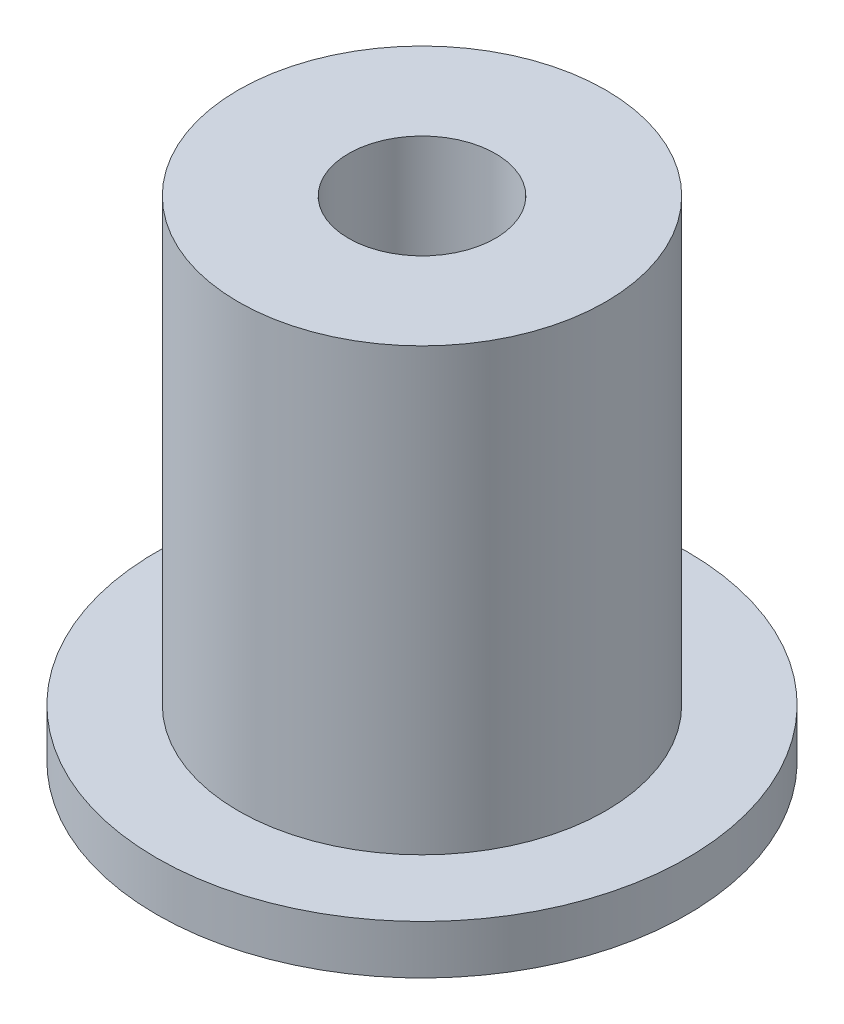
from build123d import *

# Parameters (mm, degrees)
SKETCH1_R           = 32.5
BOSS_EXTRUDE1_DEPTH = 6
SKETCH2_R           = 22.5
BOSS_EXTRUDE3_DEPTH = 54
CUT_EXTRUDE1_REACH  = 77.581
SKETCH3_R           = 9


with BuildPart() as part:
    # Sketch1 → Boss-Extrude1 (new body)
    with BuildSketch(Plane(origin=(0, 0, 0), x_dir=(1, 0, 0), z_dir=(0, 1, 0))):
        with Locations(Location((0, 0, 0), (0, 0, 270))):
            Circle(SKETCH1_R)
    extrude(amount=BOSS_EXTRUDE1_DEPTH)

    # Sketch2 → Boss-Extrude3 (add)
    with BuildSketch(Plane(origin=(0, 6, 0), x_dir=(1, 0, 0), z_dir=(0, 1, 0))):
        with Locations(Location((0, 0, 0), (0, 0, 270))):
            Circle(SKETCH2_R)
    extrude(amount=BOSS_EXTRUDE3_DEPTH)

    # Sketch3 → Cut-Extrude1 (cut, up to next)
    with BuildSketch(Plane(origin=(0, 60, 0), x_dir=(1, 0, 0), z_dir=(0, 1, 0)), mode=Mode.PRIVATE) as cut_extrude1_sk1:
        with Locations(Location((0, 0, 0), (0, 0, 270))):
            Circle(SKETCH3_R)
    cut_extrude1_tool1 = extrude(cut_extrude1_sk1.sketch, amount=-CUT_EXTRUDE1_REACH, mode=Mode.PRIVATE) & part.part
    add(cut_extrude1_tool1.solids().sort_by_distance((0, 60, 0))[0], mode=Mode.SUBTRACT)


solid = part.part
